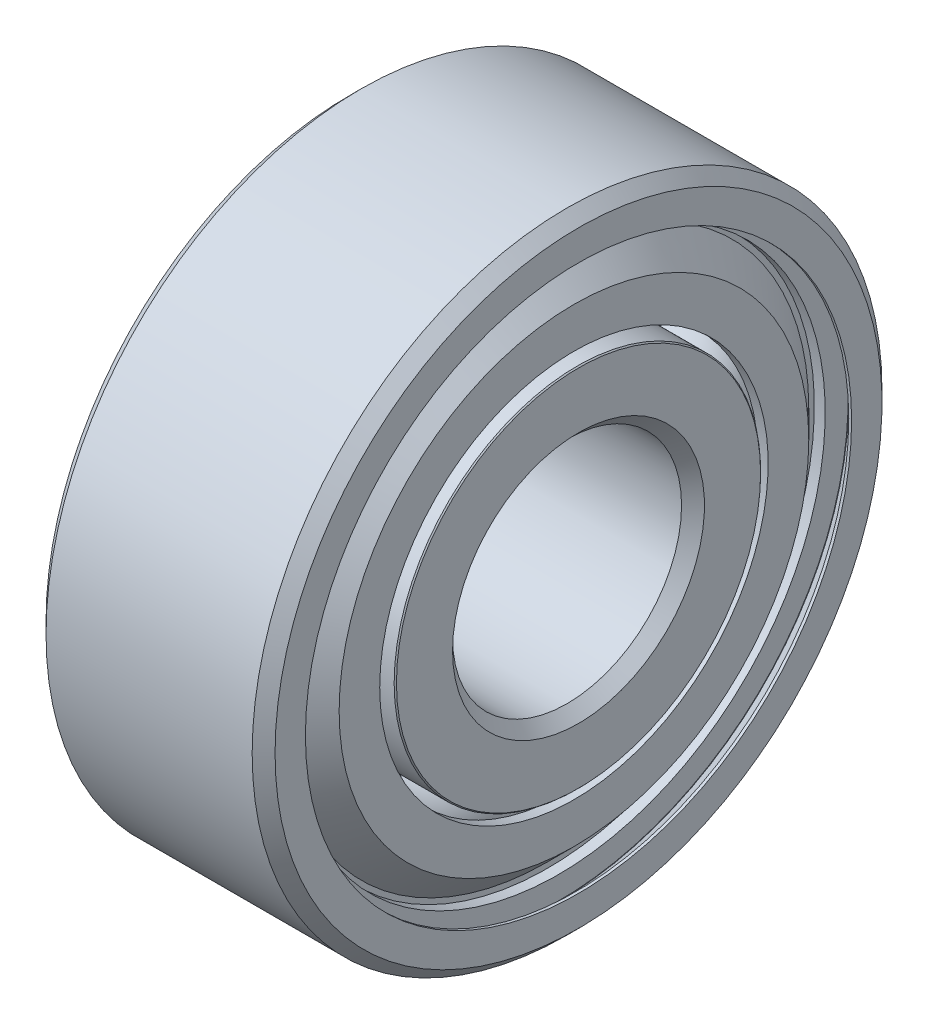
ISO-10303-21;
HEADER;
FILE_DESCRIPTION(('STEP AP214'),'2;1');
FILE_NAME('part.step','',(''),(''),'','','');
FILE_SCHEMA(('AUTOMOTIVE_DESIGN { 1 0 10303 214 1 1 1 1 }'));
ENDSEC;
DATA;
#1=APPLICATION_CONTEXT('core data for automotive mechanical design processes');
#2=APPLICATION_PROTOCOL_DEFINITION('international standard','automotive_design',2000,#1);
#3=PRODUCT_CONTEXT('',#1,'mechanical');
#4=PRODUCT('Part','Part','',(#3));
#5=PRODUCT_RELATED_PRODUCT_CATEGORY('part','',(#4));
#6=PRODUCT_DEFINITION_FORMATION('','',#4);
#7=PRODUCT_DEFINITION_CONTEXT('part definition',#1,'design');
#8=PRODUCT_DEFINITION('design','',#6,#7);
#9=PRODUCT_DEFINITION_SHAPE('','',#8);
#10=(LENGTH_UNIT() NAMED_UNIT(*) SI_UNIT(.MILLI.,.METRE.));
#11=(NAMED_UNIT(*) PLANE_ANGLE_UNIT() SI_UNIT($,.RADIAN.));
#12=(NAMED_UNIT(*) SI_UNIT($,.STERADIAN.) SOLID_ANGLE_UNIT());
#13=UNCERTAINTY_MEASURE_WITH_UNIT(LENGTH_MEASURE(1.E-05),#10,'distance_accuracy_value','');
#14=(GEOMETRIC_REPRESENTATION_CONTEXT(3) GLOBAL_UNCERTAINTY_ASSIGNED_CONTEXT((#13)) GLOBAL_UNIT_ASSIGNED_CONTEXT((#10,
#11,#12)) REPRESENTATION_CONTEXT('',''));
#15=CARTESIAN_POINT('',(0.,0.,0.));
#16=DIRECTION('',(0.,0.,1.));
#17=DIRECTION('',(1.,0.,0.));
#18=AXIS2_PLACEMENT_3D('',#15,#16,#17);
#19=CARTESIAN_POINT('',(0.,2.72236110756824,2.72236110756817));
#20=DIRECTION('',(0.,0.707106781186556,0.707106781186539));
#21=DIRECTION('',(1.,0.,0.));
#22=AXIS2_PLACEMENT_3D('',#19,#20,#21);
#23=SPHERICAL_SURFACE('',#22,1.15);
#24=CARTESIAN_POINT('',(0.,3.53553390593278,3.53553390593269));
#25=VERTEX_POINT('',#24);
#26=VERTEX_LOOP('',#25);
#27=FACE_BOUND('',#26,.T.);
#28=ADVANCED_FACE('F40',(#27),#23,.T.);
#29=CLOSED_SHELL('',(#28));
#30=MANIFOLD_SOLID_BREP('B2',#29);
#31=CARTESIAN_POINT('',(0.,0.,3.85));
#32=DIRECTION('',(0.,0.,1.));
#33=DIRECTION('',(1.,0.,0.));
#34=AXIS2_PLACEMENT_3D('',#31,#32,#33);
#35=SPHERICAL_SURFACE('',#34,1.15);
#36=CARTESIAN_POINT('',(0.,0.,5.));
#37=VERTEX_POINT('',#36);
#38=VERTEX_LOOP('',#37);
#39=FACE_BOUND('',#38,.T.);
#40=ADVANCED_FACE('F61',(#39),#35,.T.);
#41=CLOSED_SHELL('',(#40));
#42=MANIFOLD_SOLID_BREP('B6',#41);
#43=CARTESIAN_POINT('',(0.,-2.72236110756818,2.72236110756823));
#44=DIRECTION('',(0.,-0.707106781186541,0.707106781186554));
#45=DIRECTION('',(1.,0.,0.));
#46=AXIS2_PLACEMENT_3D('',#43,#44,#45);
#47=SPHERICAL_SURFACE('',#46,1.15);
#48=CARTESIAN_POINT('',(0.,-3.53553390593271,3.53553390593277));
#49=VERTEX_POINT('',#48);
#50=VERTEX_LOOP('',#49);
#51=FACE_BOUND('',#50,.T.);
#52=ADVANCED_FACE('F82',(#51),#47,.T.);
#53=CLOSED_SHELL('',(#52));
#54=MANIFOLD_SOLID_BREP('B36',#53);
#55=CARTESIAN_POINT('',(0.,-3.85,0.));
#56=DIRECTION('',(0.,-1.,0.));
#57=DIRECTION('',(1.,0.,0.));
#58=AXIS2_PLACEMENT_3D('',#55,#56,#57);
#59=SPHERICAL_SURFACE('',#58,1.15);
#60=CARTESIAN_POINT('',(0.,-5.,0.));
#61=VERTEX_POINT('',#60);
#62=VERTEX_LOOP('',#61);
#63=FACE_BOUND('',#62,.T.);
#64=ADVANCED_FACE('F103',(#63),#59,.T.);
#65=CLOSED_SHELL('',(#64));
#66=MANIFOLD_SOLID_BREP('B57',#65);
#67=CARTESIAN_POINT('',(0.,-2.72236110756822,-2.72236110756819));
#68=DIRECTION('',(0.,-0.707106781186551,-0.707106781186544));
#69=DIRECTION('',(1.,0.,0.));
#70=AXIS2_PLACEMENT_3D('',#67,#68,#69);
#71=SPHERICAL_SURFACE('',#70,1.15);
#72=CARTESIAN_POINT('',(0.,-3.53553390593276,-3.53553390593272));
#73=VERTEX_POINT('',#72);
#74=VERTEX_LOOP('',#73);
#75=FACE_BOUND('',#74,.T.);
#76=ADVANCED_FACE('F124',(#75),#71,.T.);
#77=CLOSED_SHELL('',(#76));
#78=MANIFOLD_SOLID_BREP('B78',#77);
#79=CARTESIAN_POINT('',(0.,0.,-3.85));
#80=DIRECTION('',(0.,0.,-1.));
#81=DIRECTION('',(1.,0.,0.));
#82=AXIS2_PLACEMENT_3D('',#79,#80,#81);
#83=SPHERICAL_SURFACE('',#82,1.15);
#84=CARTESIAN_POINT('',(0.,0.,-5.));
#85=VERTEX_POINT('',#84);
#86=VERTEX_LOOP('',#85);
#87=FACE_BOUND('',#86,.T.);
#88=ADVANCED_FACE('F145',(#87),#83,.T.);
#89=CLOSED_SHELL('',(#88));
#90=MANIFOLD_SOLID_BREP('B99',#89);
#91=CARTESIAN_POINT('',(0.,2.7223611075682,-2.72236110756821));
#92=DIRECTION('',(0.,0.707106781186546,-0.707106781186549));
#93=DIRECTION('',(1.,0.,0.));
#94=AXIS2_PLACEMENT_3D('',#91,#92,#93);
#95=SPHERICAL_SURFACE('',#94,1.15);
#96=CARTESIAN_POINT('',(0.,3.53553390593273,-3.53553390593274));
#97=VERTEX_POINT('',#96);
#98=VERTEX_LOOP('',#97);
#99=FACE_BOUND('',#98,.T.);
#100=ADVANCED_FACE('F166',(#99),#95,.T.);
#101=CLOSED_SHELL('',(#100));
#102=MANIFOLD_SOLID_BREP('B120',#101);
#103=CARTESIAN_POINT('',(0.,3.85,0.));
#104=DIRECTION('',(0.,1.,0.));
#105=DIRECTION('',(1.,0.,0.));
#106=AXIS2_PLACEMENT_3D('',#103,#104,#105);
#107=SPHERICAL_SURFACE('',#106,1.15);
#108=CARTESIAN_POINT('',(0.,5.,0.));
#109=VERTEX_POINT('',#108);
#110=VERTEX_LOOP('',#109);
#111=FACE_BOUND('',#110,.T.);
#112=ADVANCED_FACE('F189',(#111),#107,.T.);
#113=CLOSED_SHELL('',(#112));
#114=MANIFOLD_SOLID_BREP('B141',#113);
#115=CARTESIAN_POINT('',(0.,0.,0.));
#116=DIRECTION('',(-1.,0.,0.));
#117=DIRECTION('',(0.,0.,1.));
#118=AXIS2_PLACEMENT_3D('',#115,#116,#117);
#119=CYLINDRICAL_SURFACE('',#118,5.06042141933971);
#120=CARTESIAN_POINT('',(-1.45890813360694,0.,0.));
#121=DIRECTION('',(-1.,0.,0.));
#122=DIRECTION('',(0.,0.,1.));
#123=AXIS2_PLACEMENT_3D('',#120,#121,#122);
#124=CIRCLE('',#123,5.06042141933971);
#125=CARTESIAN_POINT('',(-1.45890813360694,0.,5.06042141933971));
#126=VERTEX_POINT('',#125);
#127=EDGE_CURVE('E225',#126,#126,#124,.T.);
#128=ORIENTED_EDGE('',*,*,#127,.T.);
#129=EDGE_LOOP('',(#128));
#130=FACE_BOUND('',#129,.T.);
#131=CARTESIAN_POINT('',(-1.64890813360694,0.,0.));
#132=DIRECTION('',(-1.,0.,0.));
#133=DIRECTION('',(0.,0.,1.));
#134=AXIS2_PLACEMENT_3D('',#131,#132,#133);
#135=CIRCLE('',#134,5.06042141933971);
#136=CARTESIAN_POINT('',(-1.64890813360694,0.,5.06042141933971));
#137=VERTEX_POINT('',#136);
#138=EDGE_CURVE('E188',#137,#137,#135,.T.);
#139=ORIENTED_EDGE('',*,*,#138,.F.);
#140=EDGE_LOOP('',(#139));
#141=FACE_BOUND('',#140,.T.);
#142=ADVANCED_FACE('F210',(#130,#141),#119,.T.);
#143=CARTESIAN_POINT('',(-1.45890813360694,5.06042141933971,0.));
#144=DIRECTION('',(1.,0.,0.));
#145=DIRECTION('',(0.,0.,-1.));
#146=AXIS2_PLACEMENT_3D('',#143,#144,#145);
#147=PLANE('',#146);
#148=CARTESIAN_POINT('',(-1.45890813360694,0.,0.));
#149=DIRECTION('',(-1.,0.,0.));
#150=DIRECTION('',(0.,0.,1.));
#151=AXIS2_PLACEMENT_3D('',#148,#149,#150);
#152=CIRCLE('',#151,4.66042141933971);
#153=CARTESIAN_POINT('',(-1.45890813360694,0.,4.66042141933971));
#154=VERTEX_POINT('',#153);
#155=EDGE_CURVE('E221',#154,#154,#152,.T.);
#156=ORIENTED_EDGE('',*,*,#155,.T.);
#157=EDGE_LOOP('',(#156));
#158=FACE_BOUND('',#157,.T.);
#159=ORIENTED_EDGE('',*,*,#127,.F.);
#160=EDGE_LOOP('',(#159));
#161=FACE_BOUND('',#160,.T.);
#162=ADVANCED_FACE('F233',(#158,#161),#147,.T.);
#163=CARTESIAN_POINT('',(0.,0.,0.));
#164=DIRECTION('',(-1.,0.,0.));
#165=DIRECTION('',(0.,0.,1.));
#166=AXIS2_PLACEMENT_3D('',#163,#164,#165);
#167=CYLINDRICAL_SURFACE('',#166,4.66042141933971);
#168=ORIENTED_EDGE('',*,*,#155,.F.);
#169=EDGE_LOOP('',(#168));
#170=FACE_BOUND('',#169,.T.);
#171=CARTESIAN_POINT('',(-1.64890813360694,0.,0.));
#172=DIRECTION('',(-1.,0.,0.));
#173=DIRECTION('',(0.,0.,1.));
#174=AXIS2_PLACEMENT_3D('',#171,#172,#173);
#175=CIRCLE('',#174,4.66042141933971);
#176=CARTESIAN_POINT('',(-1.64890813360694,0.,4.66042141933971));
#177=VERTEX_POINT('',#176);
#178=EDGE_CURVE('E217',#177,#177,#175,.T.);
#179=ORIENTED_EDGE('',*,*,#178,.T.);
#180=EDGE_LOOP('',(#179));
#181=FACE_BOUND('',#180,.T.);
#182=ADVANCED_FACE('F235',(#170,#181),#167,.F.);
#183=CARTESIAN_POINT('',(-1.64890813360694,5.06042141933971,0.));
#184=DIRECTION('',(1.,0.,0.));
#185=DIRECTION('',(0.,0.,-1.));
#186=AXIS2_PLACEMENT_3D('',#183,#184,#185);
#187=PLANE('',#186);
#188=ORIENTED_EDGE('',*,*,#178,.F.);
#189=EDGE_LOOP('',(#188));
#190=FACE_BOUND('',#189,.T.);
#191=ORIENTED_EDGE('',*,*,#138,.T.);
#192=EDGE_LOOP('',(#191));
#193=FACE_BOUND('',#192,.T.);
#194=ADVANCED_FACE('F212',(#190,#193),#187,.F.);
#195=CLOSED_SHELL('',(#142,#162,#182,#194));
#196=MANIFOLD_SOLID_BREP('B162',#195);
#197=CARTESIAN_POINT('',(0.,0.,0.));
#198=DIRECTION('',(-1.,0.,0.));
#199=DIRECTION('',(0.,0.,1.));
#200=AXIS2_PLACEMENT_3D('',#197,#198,#199);
#201=CYLINDRICAL_SURFACE('',#200,5.06042141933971);
#202=CARTESIAN_POINT('',(1.45890813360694,0.,0.));
#203=DIRECTION('',(-1.,0.,0.));
#204=DIRECTION('',(0.,0.,1.));
#205=AXIS2_PLACEMENT_3D('',#202,#203,#204);
#206=CIRCLE('',#205,5.06042141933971);
#207=CARTESIAN_POINT('',(1.45890813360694,0.,5.06042141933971));
#208=VERTEX_POINT('',#207);
#209=EDGE_CURVE('E209',#208,#208,#206,.T.);
#210=ORIENTED_EDGE('',*,*,#209,.F.);
#211=EDGE_LOOP('',(#210));
#212=FACE_BOUND('',#211,.T.);
#213=CARTESIAN_POINT('',(1.64890813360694,0.,0.));
#214=DIRECTION('',(-1.,0.,0.));
#215=DIRECTION('',(0.,0.,1.));
#216=AXIS2_PLACEMENT_3D('',#213,#214,#215);
#217=CIRCLE('',#216,5.06042141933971);
#218=CARTESIAN_POINT('',(1.64890813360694,0.,5.06042141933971));
#219=VERTEX_POINT('',#218);
#220=EDGE_CURVE('E294',#219,#219,#217,.T.);
#221=ORIENTED_EDGE('',*,*,#220,.T.);
#222=EDGE_LOOP('',(#221));
#223=FACE_BOUND('',#222,.T.);
#224=ADVANCED_FACE('F280',(#212,#223),#201,.T.);
#225=CARTESIAN_POINT('',(1.45890813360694,0.,0.));
#226=DIRECTION('',(1.,0.,0.));
#227=DIRECTION('',(0.,0.,-1.));
#228=AXIS2_PLACEMENT_3D('',#225,#226,#227);
#229=PLANE('',#228);
#230=CARTESIAN_POINT('',(1.45890813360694,0.,0.));
#231=DIRECTION('',(-1.,0.,0.));
#232=DIRECTION('',(0.,0.,1.));
#233=AXIS2_PLACEMENT_3D('',#230,#231,#232);
#234=CIRCLE('',#233,4.66042141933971);
#235=CARTESIAN_POINT('',(1.45890813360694,0.,4.66042141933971));
#236=VERTEX_POINT('',#235);
#237=EDGE_CURVE('E286',#236,#236,#234,.T.);
#238=ORIENTED_EDGE('',*,*,#237,.F.);
#239=EDGE_LOOP('',(#238));
#240=FACE_BOUND('',#239,.T.);
#241=ORIENTED_EDGE('',*,*,#209,.T.);
#242=EDGE_LOOP('',(#241));
#243=FACE_BOUND('',#242,.T.);
#244=ADVANCED_FACE('F309',(#240,#243),#229,.F.);
#245=CARTESIAN_POINT('',(0.,0.,0.));
#246=DIRECTION('',(-1.,0.,0.));
#247=DIRECTION('',(0.,0.,1.));
#248=AXIS2_PLACEMENT_3D('',#245,#246,#247);
#249=CYLINDRICAL_SURFACE('',#248,4.66042141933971);
#250=ORIENTED_EDGE('',*,*,#237,.T.);
#251=EDGE_LOOP('',(#250));
#252=FACE_BOUND('',#251,.T.);
#253=CARTESIAN_POINT('',(1.64890813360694,0.,0.));
#254=DIRECTION('',(-1.,0.,0.));
#255=DIRECTION('',(0.,0.,1.));
#256=AXIS2_PLACEMENT_3D('',#253,#254,#255);
#257=CIRCLE('',#256,4.66042141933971);
#258=CARTESIAN_POINT('',(1.64890813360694,0.,4.66042141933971));
#259=VERTEX_POINT('',#258);
#260=EDGE_CURVE('E290',#259,#259,#257,.T.);
#261=ORIENTED_EDGE('',*,*,#260,.F.);
#262=EDGE_LOOP('',(#261));
#263=FACE_BOUND('',#262,.T.);
#264=ADVANCED_FACE('F303',(#252,#263),#249,.F.);
#265=CARTESIAN_POINT('',(1.64890813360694,0.,0.));
#266=DIRECTION('',(1.,0.,0.));
#267=DIRECTION('',(0.,0.,-1.));
#268=AXIS2_PLACEMENT_3D('',#265,#266,#267);
#269=PLANE('',#268);
#270=ORIENTED_EDGE('',*,*,#260,.T.);
#271=EDGE_LOOP('',(#270));
#272=FACE_BOUND('',#271,.T.);
#273=ORIENTED_EDGE('',*,*,#220,.F.);
#274=EDGE_LOOP('',(#273));
#275=FACE_BOUND('',#274,.T.);
#276=ADVANCED_FACE('F301',(#272,#275),#269,.T.);
#277=CLOSED_SHELL('',(#224,#244,#264,#276));
#278=MANIFOLD_SOLID_BREP('B183',#277);
#279=CARTESIAN_POINT('',(-1.26704448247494,0.,0.));
#280=DIRECTION('',(-1.,0.,0.));
#281=DIRECTION('',(0.,0.,1.));
#282=AXIS2_PLACEMENT_3D('',#279,#280,#281);
#283=PLANE('',#282);
#284=CARTESIAN_POINT('',(-1.26704448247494,0.,0.));
#285=DIRECTION('',(-1.,0.,0.));
#286=DIRECTION('',(0.,0.,1.));
#287=AXIS2_PLACEMENT_3D('',#284,#285,#286);
#288=CIRCLE('',#287,4.7565158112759);
#289=CARTESIAN_POINT('',(-1.26704448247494,0.,4.7565158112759));
#290=VERTEX_POINT('',#289);
#291=EDGE_CURVE('E279',#290,#290,#288,.T.);
#292=ORIENTED_EDGE('',*,*,#291,.F.);
#293=EDGE_LOOP('',(#292));
#294=FACE_BOUND('',#293,.T.);
#295=CARTESIAN_POINT('',(-1.26704448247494,0.,0.));
#296=DIRECTION('',(-1.,0.,0.));
#297=DIRECTION('',(0.,0.,1.));
#298=AXIS2_PLACEMENT_3D('',#295,#296,#297);
#299=CIRCLE('',#298,4.5);
#300=CARTESIAN_POINT('',(-1.26704448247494,0.,4.5));
#301=VERTEX_POINT('',#300);
#302=EDGE_CURVE('E378',#301,#301,#299,.T.);
#303=ORIENTED_EDGE('',*,*,#302,.T.);
#304=EDGE_LOOP('',(#303));
#305=FACE_BOUND('',#304,.T.);
#306=ADVANCED_FACE('F350',(#294,#305),#283,.F.);
#307=CARTESIAN_POINT('',(0.,0.,0.));
#308=DIRECTION('',(-1.,0.,0.));
#309=DIRECTION('',(0.,0.,1.));
#310=AXIS2_PLACEMENT_3D('',#307,#308,#309);
#311=CYLINDRICAL_SURFACE('',#310,4.7565158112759);
#312=CARTESIAN_POINT('',(-1.44704448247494,0.,0.));
#313=DIRECTION('',(-1.,0.,0.));
#314=DIRECTION('',(0.,0.,1.));
#315=AXIS2_PLACEMENT_3D('',#312,#313,#314);
#316=CIRCLE('',#315,4.7565158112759);
#317=CARTESIAN_POINT('',(-1.44704448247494,0.,4.7565158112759));
#318=VERTEX_POINT('',#317);
#319=EDGE_CURVE('E356',#318,#318,#316,.T.);
#320=ORIENTED_EDGE('',*,*,#319,.F.);
#321=EDGE_LOOP('',(#320));
#322=FACE_BOUND('',#321,.T.);
#323=ORIENTED_EDGE('',*,*,#291,.T.);
#324=EDGE_LOOP('',(#323));
#325=FACE_BOUND('',#324,.T.);
#326=ADVANCED_FACE('F415',(#322,#325),#311,.T.);
#327=CARTESIAN_POINT('',(-1.44704448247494,0.,0.));
#328=DIRECTION('',(1.,0.,0.));
#329=DIRECTION('',(0.,0.,-1.));
#330=AXIS2_PLACEMENT_3D('',#327,#328,#329);
#331=PLANE('',#330);
#332=CARTESIAN_POINT('',(-1.44704448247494,0.,0.));
#333=DIRECTION('',(-1.,0.,0.));
#334=DIRECTION('',(0.,0.,1.));
#335=AXIS2_PLACEMENT_3D('',#332,#333,#334);
#336=CIRCLE('',#335,4.57455844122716);
#337=CARTESIAN_POINT('',(-1.44704448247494,0.,4.57455844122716));
#338=VERTEX_POINT('',#337);
#339=EDGE_CURVE('E360',#338,#338,#336,.T.);
#340=ORIENTED_EDGE('',*,*,#339,.F.);
#341=EDGE_LOOP('',(#340));
#342=FACE_BOUND('',#341,.T.);
#343=ORIENTED_EDGE('',*,*,#319,.T.);
#344=EDGE_LOOP('',(#343));
#345=FACE_BOUND('',#344,.T.);
#346=ADVANCED_FACE('F410',(#342,#345),#331,.F.);
#347=CARTESIAN_POINT('',(-1.44704448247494,0.,0.));
#348=DIRECTION('',(1.,0.,0.));
#349=DIRECTION('',(0.,0.,-1.));
#350=AXIS2_PLACEMENT_3D('',#347,#348,#349);
#351=CONICAL_SURFACE('',#350,4.57455844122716,0.785398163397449);
#352=CARTESIAN_POINT('',(-1.92036514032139,0.,0.));
#353=DIRECTION('',(-1.,0.,0.));
#354=DIRECTION('',(0.,0.,1.));
#355=AXIS2_PLACEMENT_3D('',#352,#353,#354);
#356=CIRCLE('',#355,4.10123778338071);
#357=CARTESIAN_POINT('',(-1.92036514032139,0.,4.10123778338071));
#358=VERTEX_POINT('',#357);
#359=EDGE_CURVE('E364',#358,#358,#356,.T.);
#360=ORIENTED_EDGE('',*,*,#359,.F.);
#361=EDGE_LOOP('',(#360));
#362=FACE_BOUND('',#361,.T.);
#363=ORIENTED_EDGE('',*,*,#339,.T.);
#364=EDGE_LOOP('',(#363));
#365=FACE_BOUND('',#364,.T.);
#366=ADVANCED_FACE('F404',(#362,#365),#351,.T.);
#367=CARTESIAN_POINT('',(-1.92036514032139,0.,0.));
#368=DIRECTION('',(1.,0.,0.));
#369=DIRECTION('',(0.,0.,-1.));
#370=AXIS2_PLACEMENT_3D('',#367,#368,#369);
#371=PLANE('',#370);
#372=CARTESIAN_POINT('',(-1.92036514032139,0.,0.));
#373=DIRECTION('',(-1.,0.,0.));
#374=DIRECTION('',(0.,0.,1.));
#375=AXIS2_PLACEMENT_3D('',#372,#373,#374);
#376=CIRCLE('',#375,3.39254384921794);
#377=CARTESIAN_POINT('',(-1.92036514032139,0.,3.39254384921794));
#378=VERTEX_POINT('',#377);
#379=EDGE_CURVE('E369',#378,#378,#376,.T.);
#380=ORIENTED_EDGE('',*,*,#379,.F.);
#381=EDGE_LOOP('',(#380));
#382=FACE_BOUND('',#381,.T.);
#383=ORIENTED_EDGE('',*,*,#359,.T.);
#384=EDGE_LOOP('',(#383));
#385=FACE_BOUND('',#384,.T.);
#386=ADVANCED_FACE('F398',(#382,#385),#371,.F.);
#387=CARTESIAN_POINT('',(0.,0.,0.));
#388=DIRECTION('',(-1.,0.,0.));
#389=DIRECTION('',(0.,0.,1.));
#390=AXIS2_PLACEMENT_3D('',#387,#388,#389);
#391=CYLINDRICAL_SURFACE('',#390,3.39254384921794);
#392=CARTESIAN_POINT('',(-1.74036514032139,0.,0.));
#393=DIRECTION('',(-1.,0.,0.));
#394=DIRECTION('',(0.,0.,1.));
#395=AXIS2_PLACEMENT_3D('',#392,#393,#394);
#396=CIRCLE('',#395,3.39254384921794);
#397=CARTESIAN_POINT('',(-1.74036514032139,0.,3.39254384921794));
#398=VERTEX_POINT('',#397);
#399=EDGE_CURVE('E372',#398,#398,#396,.T.);
#400=ORIENTED_EDGE('',*,*,#399,.F.);
#401=EDGE_LOOP('',(#400));
#402=FACE_BOUND('',#401,.T.);
#403=ORIENTED_EDGE('',*,*,#379,.T.);
#404=EDGE_LOOP('',(#403));
#405=FACE_BOUND('',#404,.T.);
#406=ADVANCED_FACE('F392',(#402,#405),#391,.F.);
#407=CARTESIAN_POINT('',(-1.74036514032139,0.,0.));
#408=DIRECTION('',(-1.,0.,0.));
#409=DIRECTION('',(0.,0.,1.));
#410=AXIS2_PLACEMENT_3D('',#407,#408,#409);
#411=PLANE('',#410);
#412=CARTESIAN_POINT('',(-1.74036514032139,0.,0.));
#413=DIRECTION('',(-1.,0.,0.));
#414=DIRECTION('',(0.,0.,1.));
#415=AXIS2_PLACEMENT_3D('',#412,#413,#414);
#416=CIRCLE('',#415,4.02667934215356);
#417=CARTESIAN_POINT('',(-1.74036514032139,0.,4.02667934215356));
#418=VERTEX_POINT('',#417);
#419=EDGE_CURVE('E375',#418,#418,#416,.T.);
#420=ORIENTED_EDGE('',*,*,#419,.F.);
#421=EDGE_LOOP('',(#420));
#422=FACE_BOUND('',#421,.T.);
#423=ORIENTED_EDGE('',*,*,#399,.T.);
#424=EDGE_LOOP('',(#423));
#425=FACE_BOUND('',#424,.T.);
#426=ADVANCED_FACE('F386',(#422,#425),#411,.F.);
#427=CARTESIAN_POINT('',(-1.74036514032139,0.,0.));
#428=DIRECTION('',(1.,0.,0.));
#429=DIRECTION('',(0.,0.,-1.));
#430=AXIS2_PLACEMENT_3D('',#427,#428,#429);
#431=CONICAL_SURFACE('',#430,4.02667934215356,0.785398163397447);
#432=ORIENTED_EDGE('',*,*,#302,.F.);
#433=EDGE_LOOP('',(#432));
#434=FACE_BOUND('',#433,.T.);
#435=ORIENTED_EDGE('',*,*,#419,.T.);
#436=EDGE_LOOP('',(#435));
#437=FACE_BOUND('',#436,.T.);
#438=ADVANCED_FACE('F383',(#434,#437),#431,.F.);
#439=CLOSED_SHELL('',(#306,#326,#346,#366,#386,#406,#426,#438));
#440=MANIFOLD_SOLID_BREP('B204',#439);
#441=CARTESIAN_POINT('',(1.92036514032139,0.,0.));
#442=DIRECTION('',(1.,0.,0.));
#443=DIRECTION('',(0.,0.,-1.));
#444=AXIS2_PLACEMENT_3D('',#441,#442,#443);
#445=PLANE('',#444);
#446=CARTESIAN_POINT('',(1.92036514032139,0.,0.));
#447=DIRECTION('',(-1.,0.,0.));
#448=DIRECTION('',(0.,0.,1.));
#449=AXIS2_PLACEMENT_3D('',#446,#447,#448);
#450=CIRCLE('',#449,3.39254384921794);
#451=CARTESIAN_POINT('',(1.92036514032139,0.,3.39254384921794));
#452=VERTEX_POINT('',#451);
#453=EDGE_CURVE('E508',#452,#452,#450,.T.);
#454=ORIENTED_EDGE('',*,*,#453,.T.);
#455=EDGE_LOOP('',(#454));
#456=FACE_BOUND('',#455,.T.);
#457=CARTESIAN_POINT('',(1.92036514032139,0.,0.));
#458=DIRECTION('',(-1.,0.,0.));
#459=DIRECTION('',(0.,0.,1.));
#460=AXIS2_PLACEMENT_3D('',#457,#458,#459);
#461=CIRCLE('',#460,4.10123778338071);
#462=CARTESIAN_POINT('',(1.92036514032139,0.,4.10123778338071));
#463=VERTEX_POINT('',#462);
#464=EDGE_CURVE('E349',#463,#463,#461,.T.);
#465=ORIENTED_EDGE('',*,*,#464,.F.);
#466=EDGE_LOOP('',(#465));
#467=FACE_BOUND('',#466,.T.);
#468=ADVANCED_FACE('F480',(#456,#467),#445,.T.);
#469=CARTESIAN_POINT('',(1.44704448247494,0.,0.));
#470=DIRECTION('',(-1.,0.,0.));
#471=DIRECTION('',(0.,0.,1.));
#472=AXIS2_PLACEMENT_3D('',#469,#470,#471);
#473=CONICAL_SURFACE('',#472,4.57455844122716,0.785398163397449);
#474=ORIENTED_EDGE('',*,*,#464,.T.);
#475=EDGE_LOOP('',(#474));
#476=FACE_BOUND('',#475,.T.);
#477=CARTESIAN_POINT('',(1.44704448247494,0.,0.));
#478=DIRECTION('',(-1.,0.,0.));
#479=DIRECTION('',(0.,0.,1.));
#480=AXIS2_PLACEMENT_3D('',#477,#478,#479);
#481=CIRCLE('',#480,4.57455844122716);
#482=CARTESIAN_POINT('',(1.44704448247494,0.,4.57455844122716));
#483=VERTEX_POINT('',#482);
#484=EDGE_CURVE('E486',#483,#483,#481,.T.);
#485=ORIENTED_EDGE('',*,*,#484,.F.);
#486=EDGE_LOOP('',(#485));
#487=FACE_BOUND('',#486,.T.);
#488=ADVANCED_FACE('F526',(#476,#487),#473,.T.);
#489=CARTESIAN_POINT('',(1.44704448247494,0.,0.));
#490=DIRECTION('',(1.,0.,0.));
#491=DIRECTION('',(0.,0.,-1.));
#492=AXIS2_PLACEMENT_3D('',#489,#490,#491);
#493=PLANE('',#492);
#494=ORIENTED_EDGE('',*,*,#484,.T.);
#495=EDGE_LOOP('',(#494));
#496=FACE_BOUND('',#495,.T.);
#497=CARTESIAN_POINT('',(1.44704448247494,0.,0.));
#498=DIRECTION('',(-1.,0.,0.));
#499=DIRECTION('',(0.,0.,1.));
#500=AXIS2_PLACEMENT_3D('',#497,#498,#499);
#501=CIRCLE('',#500,4.7565158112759);
#502=CARTESIAN_POINT('',(1.44704448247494,0.,4.7565158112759));
#503=VERTEX_POINT('',#502);
#504=EDGE_CURVE('E490',#503,#503,#501,.T.);
#505=ORIENTED_EDGE('',*,*,#504,.F.);
#506=EDGE_LOOP('',(#505));
#507=FACE_BOUND('',#506,.T.);
#508=ADVANCED_FACE('F530',(#496,#507),#493,.T.);
#509=CARTESIAN_POINT('',(0.,0.,0.));
#510=DIRECTION('',(-1.,0.,0.));
#511=DIRECTION('',(0.,0.,1.));
#512=AXIS2_PLACEMENT_3D('',#509,#510,#511);
#513=CYLINDRICAL_SURFACE('',#512,4.7565158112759);
#514=ORIENTED_EDGE('',*,*,#504,.T.);
#515=EDGE_LOOP('',(#514));
#516=FACE_BOUND('',#515,.T.);
#517=CARTESIAN_POINT('',(1.26704448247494,0.,0.));
#518=DIRECTION('',(-1.,0.,0.));
#519=DIRECTION('',(0.,0.,1.));
#520=AXIS2_PLACEMENT_3D('',#517,#518,#519);
#521=CIRCLE('',#520,4.7565158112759);
#522=CARTESIAN_POINT('',(1.26704448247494,0.,4.7565158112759));
#523=VERTEX_POINT('',#522);
#524=EDGE_CURVE('E494',#523,#523,#521,.T.);
#525=ORIENTED_EDGE('',*,*,#524,.F.);
#526=EDGE_LOOP('',(#525));
#527=FACE_BOUND('',#526,.T.);
#528=ADVANCED_FACE('F534',(#516,#527),#513,.T.);
#529=CARTESIAN_POINT('',(1.26704448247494,0.,0.));
#530=DIRECTION('',(-1.,0.,0.));
#531=DIRECTION('',(0.,0.,1.));
#532=AXIS2_PLACEMENT_3D('',#529,#530,#531);
#533=PLANE('',#532);
#534=ORIENTED_EDGE('',*,*,#524,.T.);
#535=EDGE_LOOP('',(#534));
#536=FACE_BOUND('',#535,.T.);
#537=CARTESIAN_POINT('',(1.26704448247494,0.,0.));
#538=DIRECTION('',(-1.,0.,0.));
#539=DIRECTION('',(0.,0.,1.));
#540=AXIS2_PLACEMENT_3D('',#537,#538,#539);
#541=CIRCLE('',#540,4.5);
#542=CARTESIAN_POINT('',(1.26704448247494,0.,4.5));
#543=VERTEX_POINT('',#542);
#544=EDGE_CURVE('E499',#543,#543,#541,.T.);
#545=ORIENTED_EDGE('',*,*,#544,.F.);
#546=EDGE_LOOP('',(#545));
#547=FACE_BOUND('',#546,.T.);
#548=ADVANCED_FACE('F540',(#536,#547),#533,.T.);
#549=CARTESIAN_POINT('',(1.74036514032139,0.,0.));
#550=DIRECTION('',(-1.,0.,0.));
#551=DIRECTION('',(0.,0.,1.));
#552=AXIS2_PLACEMENT_3D('',#549,#550,#551);
#553=CONICAL_SURFACE('',#552,4.02667934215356,0.785398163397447);
#554=ORIENTED_EDGE('',*,*,#544,.T.);
#555=EDGE_LOOP('',(#554));
#556=FACE_BOUND('',#555,.T.);
#557=CARTESIAN_POINT('',(1.74036514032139,0.,0.));
#558=DIRECTION('',(-1.,0.,0.));
#559=DIRECTION('',(0.,0.,1.));
#560=AXIS2_PLACEMENT_3D('',#557,#558,#559);
#561=CIRCLE('',#560,4.02667934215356);
#562=CARTESIAN_POINT('',(1.74036514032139,0.,4.02667934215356));
#563=VERTEX_POINT('',#562);
#564=EDGE_CURVE('E502',#563,#563,#561,.T.);
#565=ORIENTED_EDGE('',*,*,#564,.F.);
#566=EDGE_LOOP('',(#565));
#567=FACE_BOUND('',#566,.T.);
#568=ADVANCED_FACE('F522',(#556,#567),#553,.F.);
#569=CARTESIAN_POINT('',(1.74036514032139,0.,0.));
#570=DIRECTION('',(-1.,0.,0.));
#571=DIRECTION('',(0.,0.,1.));
#572=AXIS2_PLACEMENT_3D('',#569,#570,#571);
#573=PLANE('',#572);
#574=ORIENTED_EDGE('',*,*,#564,.T.);
#575=EDGE_LOOP('',(#574));
#576=FACE_BOUND('',#575,.T.);
#577=CARTESIAN_POINT('',(1.74036514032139,0.,0.));
#578=DIRECTION('',(-1.,0.,0.));
#579=DIRECTION('',(0.,0.,1.));
#580=AXIS2_PLACEMENT_3D('',#577,#578,#579);
#581=CIRCLE('',#580,3.39254384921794);
#582=CARTESIAN_POINT('',(1.74036514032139,0.,3.39254384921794));
#583=VERTEX_POINT('',#582);
#584=EDGE_CURVE('E505',#583,#583,#581,.T.);
#585=ORIENTED_EDGE('',*,*,#584,.F.);
#586=EDGE_LOOP('',(#585));
#587=FACE_BOUND('',#586,.T.);
#588=ADVANCED_FACE('F516',(#576,#587),#573,.T.);
#589=CARTESIAN_POINT('',(0.,0.,0.));
#590=DIRECTION('',(-1.,0.,0.));
#591=DIRECTION('',(0.,0.,1.));
#592=AXIS2_PLACEMENT_3D('',#589,#590,#591);
#593=CYLINDRICAL_SURFACE('',#592,3.39254384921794);
#594=ORIENTED_EDGE('',*,*,#584,.T.);
#595=EDGE_LOOP('',(#594));
#596=FACE_BOUND('',#595,.T.);
#597=ORIENTED_EDGE('',*,*,#453,.F.);
#598=EDGE_LOOP('',(#597));
#599=FACE_BOUND('',#598,.T.);
#600=ADVANCED_FACE('F514',(#596,#599),#593,.F.);
#601=CLOSED_SHELL('',(#468,#488,#508,#528,#548,#568,#588,#600));
#602=MANIFOLD_SOLID_BREP('B274',#601);
#603=CARTESIAN_POINT('',(0.,0.,0.));
#604=DIRECTION('',(-1.,0.,0.));
#605=DIRECTION('',(0.,0.,1.));
#606=AXIS2_PLACEMENT_3D('',#603,#604,#605);
#607=TOROIDAL_SURFACE('',#606,3.85,1.2);
#608=CARTESIAN_POINT('',(1.0087120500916,0.,0.));
#609=DIRECTION('',(-1.,0.,0.));
#610=DIRECTION('',(0.,0.,1.));
#611=AXIS2_PLACEMENT_3D('',#608,#609,#610);
#612=CIRCLE('',#611,3.2);
#613=CARTESIAN_POINT('',(1.0087120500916,0.,3.2));
#614=VERTEX_POINT('',#613);
#615=EDGE_CURVE('E643',#614,#614,#612,.T.);
#616=ORIENTED_EDGE('',*,*,#615,.T.);
#617=EDGE_LOOP('',(#616));
#618=FACE_BOUND('',#617,.T.);
#619=CARTESIAN_POINT('',(-1.0087120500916,0.,0.));
#620=DIRECTION('',(-1.,0.,0.));
#621=DIRECTION('',(0.,0.,1.));
#622=AXIS2_PLACEMENT_3D('',#619,#620,#621);
#623=CIRCLE('',#622,3.2);
#624=CARTESIAN_POINT('',(-1.0087120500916,0.,3.2));
#625=VERTEX_POINT('',#624);
#626=EDGE_CURVE('E479',#625,#625,#623,.T.);
#627=ORIENTED_EDGE('',*,*,#626,.F.);
#628=EDGE_LOOP('',(#627));
#629=FACE_BOUND('',#628,.T.);
#630=ADVANCED_FACE('F609',(#618,#629),#607,.F.);
#631=CARTESIAN_POINT('',(0.,0.,0.));
#632=DIRECTION('',(-1.,0.,0.));
#633=DIRECTION('',(0.,0.,1.));
#634=AXIS2_PLACEMENT_3D('',#631,#632,#633);
#635=CYLINDRICAL_SURFACE('',#634,3.2);
#636=CARTESIAN_POINT('',(-1.98,0.,0.));
#637=DIRECTION('',(-1.,0.,0.));
#638=DIRECTION('',(0.,0.,1.));
#639=AXIS2_PLACEMENT_3D('',#636,#637,#638);
#640=CIRCLE('',#639,3.2);
#641=CARTESIAN_POINT('',(-1.98,0.,3.2));
#642=VERTEX_POINT('',#641);
#643=EDGE_CURVE('E615',#642,#642,#640,.T.);
#644=ORIENTED_EDGE('',*,*,#643,.F.);
#645=EDGE_LOOP('',(#644));
#646=FACE_BOUND('',#645,.T.);
#647=ORIENTED_EDGE('',*,*,#626,.T.);
#648=EDGE_LOOP('',(#647));
#649=FACE_BOUND('',#648,.T.);
#650=ADVANCED_FACE('F693',(#646,#649),#635,.T.);
#651=CARTESIAN_POINT('',(-1.98,0.,0.));
#652=DIRECTION('',(1.,0.,0.));
#653=DIRECTION('',(0.,0.,-1.));
#654=AXIS2_PLACEMENT_3D('',#651,#652,#653);
#655=CONICAL_SURFACE('',#654,3.2,0.78539816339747);
#656=CARTESIAN_POINT('',(-2.,0.,0.));
#657=DIRECTION('',(-1.,0.,0.));
#658=DIRECTION('',(0.,0.,1.));
#659=AXIS2_PLACEMENT_3D('',#656,#657,#658);
#660=CIRCLE('',#659,3.18);
#661=CARTESIAN_POINT('',(-2.,0.,3.18));
#662=VERTEX_POINT('',#661);
#663=EDGE_CURVE('E619',#662,#662,#660,.T.);
#664=ORIENTED_EDGE('',*,*,#663,.F.);
#665=EDGE_LOOP('',(#664));
#666=FACE_BOUND('',#665,.T.);
#667=ORIENTED_EDGE('',*,*,#643,.T.);
#668=EDGE_LOOP('',(#667));
#669=FACE_BOUND('',#668,.T.);
#670=ADVANCED_FACE('F688',(#666,#669),#655,.T.);
#671=CARTESIAN_POINT('',(-2.,0.,0.));
#672=DIRECTION('',(1.,0.,0.));
#673=DIRECTION('',(0.,0.,-1.));
#674=AXIS2_PLACEMENT_3D('',#671,#672,#673);
#675=PLANE('',#674);
#676=CARTESIAN_POINT('',(-2.,0.,0.));
#677=DIRECTION('',(-1.,0.,0.));
#678=DIRECTION('',(0.,0.,1.));
#679=AXIS2_PLACEMENT_3D('',#676,#677,#678);
#680=CIRCLE('',#679,2.2);
#681=CARTESIAN_POINT('',(-2.,0.,2.2));
#682=VERTEX_POINT('',#681);
#683=EDGE_CURVE('E623',#682,#682,#680,.T.);
#684=ORIENTED_EDGE('',*,*,#683,.F.);
#685=EDGE_LOOP('',(#684));
#686=FACE_BOUND('',#685,.T.);
#687=ORIENTED_EDGE('',*,*,#663,.T.);
#688=EDGE_LOOP('',(#687));
#689=FACE_BOUND('',#688,.T.);
#690=ADVANCED_FACE('F682',(#686,#689),#675,.F.);
#691=CARTESIAN_POINT('',(-2.,0.,0.));
#692=DIRECTION('',(-1.,0.,0.));
#693=DIRECTION('',(0.,0.,1.));
#694=AXIS2_PLACEMENT_3D('',#691,#692,#693);
#695=CONICAL_SURFACE('',#694,2.2,0.785398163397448);
#696=CARTESIAN_POINT('',(-1.8,0.,0.));
#697=DIRECTION('',(-1.,0.,0.));
#698=DIRECTION('',(0.,0.,1.));
#699=AXIS2_PLACEMENT_3D('',#696,#697,#698);
#700=CIRCLE('',#699,2.);
#701=CARTESIAN_POINT('',(-1.8,0.,2.));
#702=VERTEX_POINT('',#701);
#703=EDGE_CURVE('E628',#702,#702,#700,.T.);
#704=ORIENTED_EDGE('',*,*,#703,.F.);
#705=EDGE_LOOP('',(#704));
#706=FACE_BOUND('',#705,.T.);
#707=ORIENTED_EDGE('',*,*,#683,.T.);
#708=EDGE_LOOP('',(#707));
#709=FACE_BOUND('',#708,.T.);
#710=ADVANCED_FACE('F676',(#706,#709),#695,.F.);
#711=CARTESIAN_POINT('',(0.,0.,0.));
#712=DIRECTION('',(-1.,0.,0.));
#713=DIRECTION('',(0.,0.,1.));
#714=AXIS2_PLACEMENT_3D('',#711,#712,#713);
#715=CYLINDRICAL_SURFACE('',#714,2.);
#716=CARTESIAN_POINT('',(1.8,0.,0.));
#717=DIRECTION('',(-1.,0.,0.));
#718=DIRECTION('',(0.,0.,1.));
#719=AXIS2_PLACEMENT_3D('',#716,#717,#718);
#720=CIRCLE('',#719,2.);
#721=CARTESIAN_POINT('',(1.8,0.,2.));
#722=VERTEX_POINT('',#721);
#723=EDGE_CURVE('E631',#722,#722,#720,.T.);
#724=ORIENTED_EDGE('',*,*,#723,.F.);
#725=EDGE_LOOP('',(#724));
#726=FACE_BOUND('',#725,.T.);
#727=ORIENTED_EDGE('',*,*,#703,.T.);
#728=EDGE_LOOP('',(#727));
#729=FACE_BOUND('',#728,.T.);
#730=ADVANCED_FACE('F670',(#726,#729),#715,.F.);
#731=CARTESIAN_POINT('',(1.8,0.,0.));
#732=DIRECTION('',(1.,0.,0.));
#733=DIRECTION('',(0.,0.,-1.));
#734=AXIS2_PLACEMENT_3D('',#731,#732,#733);
#735=CONICAL_SURFACE('',#734,2.,0.785398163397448);
#736=CARTESIAN_POINT('',(2.,0.,0.));
#737=DIRECTION('',(-1.,0.,0.));
#738=DIRECTION('',(0.,0.,1.));
#739=AXIS2_PLACEMENT_3D('',#736,#737,#738);
#740=CIRCLE('',#739,2.2);
#741=CARTESIAN_POINT('',(2.,0.,2.2));
#742=VERTEX_POINT('',#741);
#743=EDGE_CURVE('E634',#742,#742,#740,.T.);
#744=ORIENTED_EDGE('',*,*,#743,.F.);
#745=EDGE_LOOP('',(#744));
#746=FACE_BOUND('',#745,.T.);
#747=ORIENTED_EDGE('',*,*,#723,.T.);
#748=EDGE_LOOP('',(#747));
#749=FACE_BOUND('',#748,.T.);
#750=ADVANCED_FACE('F664',(#746,#749),#735,.F.);
#751=CARTESIAN_POINT('',(2.,0.,0.));
#752=DIRECTION('',(-1.,0.,0.));
#753=DIRECTION('',(0.,0.,1.));
#754=AXIS2_PLACEMENT_3D('',#751,#752,#753);
#755=PLANE('',#754);
#756=CARTESIAN_POINT('',(2.,0.,0.));
#757=DIRECTION('',(-1.,0.,0.));
#758=DIRECTION('',(0.,0.,1.));
#759=AXIS2_PLACEMENT_3D('',#756,#757,#758);
#760=CIRCLE('',#759,3.18);
#761=CARTESIAN_POINT('',(2.,0.,3.18));
#762=VERTEX_POINT('',#761);
#763=EDGE_CURVE('E637',#762,#762,#760,.T.);
#764=ORIENTED_EDGE('',*,*,#763,.F.);
#765=EDGE_LOOP('',(#764));
#766=FACE_BOUND('',#765,.T.);
#767=ORIENTED_EDGE('',*,*,#743,.T.);
#768=EDGE_LOOP('',(#767));
#769=FACE_BOUND('',#768,.T.);
#770=ADVANCED_FACE('F658',(#766,#769),#755,.F.);
#771=CARTESIAN_POINT('',(2.,0.,0.));
#772=DIRECTION('',(-1.,0.,0.));
#773=DIRECTION('',(0.,0.,1.));
#774=AXIS2_PLACEMENT_3D('',#771,#772,#773);
#775=CONICAL_SURFACE('',#774,3.18,0.785398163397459);
#776=CARTESIAN_POINT('',(1.98,0.,0.));
#777=DIRECTION('',(-1.,0.,0.));
#778=DIRECTION('',(0.,0.,1.));
#779=AXIS2_PLACEMENT_3D('',#776,#777,#778);
#780=CIRCLE('',#779,3.2);
#781=CARTESIAN_POINT('',(1.98,0.,3.2));
#782=VERTEX_POINT('',#781);
#783=EDGE_CURVE('E640',#782,#782,#780,.T.);
#784=ORIENTED_EDGE('',*,*,#783,.F.);
#785=EDGE_LOOP('',(#784));
#786=FACE_BOUND('',#785,.T.);
#787=ORIENTED_EDGE('',*,*,#763,.T.);
#788=EDGE_LOOP('',(#787));
#789=FACE_BOUND('',#788,.T.);
#790=ADVANCED_FACE('F652',(#786,#789),#775,.T.);
#791=CARTESIAN_POINT('',(0.,0.,0.));
#792=DIRECTION('',(-1.,0.,0.));
#793=DIRECTION('',(0.,0.,1.));
#794=AXIS2_PLACEMENT_3D('',#791,#792,#793);
#795=CYLINDRICAL_SURFACE('',#794,3.2);
#796=ORIENTED_EDGE('',*,*,#615,.F.);
#797=EDGE_LOOP('',(#796));
#798=FACE_BOUND('',#797,.T.);
#799=ORIENTED_EDGE('',*,*,#783,.T.);
#800=EDGE_LOOP('',(#799));
#801=FACE_BOUND('',#800,.T.);
#802=ADVANCED_FACE('F649',(#798,#801),#795,.T.);
#803=CLOSED_SHELL('',(#630,#650,#670,#690,#710,#730,#750,#770,#790,#802));
#804=MANIFOLD_SOLID_BREP('B344',#803);
#805=CARTESIAN_POINT('',(0.,0.,0.));
#806=DIRECTION('',(-1.,0.,0.));
#807=DIRECTION('',(0.,0.,1.));
#808=AXIS2_PLACEMENT_3D('',#805,#806,#807);
#809=TOROIDAL_SURFACE('',#808,3.85,1.2);
#810=CARTESIAN_POINT('',(-1.0087120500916,0.,0.));
#811=DIRECTION('',(-1.,0.,0.));
#812=DIRECTION('',(0.,0.,1.));
#813=AXIS2_PLACEMENT_3D('',#810,#811,#812);
#814=CIRCLE('',#813,4.5);
#815=CARTESIAN_POINT('',(-1.0087120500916,0.,4.5));
#816=VERTEX_POINT('',#815);
#817=EDGE_CURVE('E825',#816,#816,#814,.T.);
#818=ORIENTED_EDGE('',*,*,#817,.T.);
#819=EDGE_LOOP('',(#818));
#820=FACE_BOUND('',#819,.T.);
#821=CARTESIAN_POINT('',(1.0087120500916,0.,0.));
#822=DIRECTION('',(-1.,0.,0.));
#823=DIRECTION('',(0.,0.,1.));
#824=AXIS2_PLACEMENT_3D('',#821,#822,#823);
#825=CIRCLE('',#824,4.5);
#826=CARTESIAN_POINT('',(1.0087120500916,0.,4.5));
#827=VERTEX_POINT('',#826);
#828=EDGE_CURVE('E608',#827,#827,#825,.T.);
#829=ORIENTED_EDGE('',*,*,#828,.F.);
#830=EDGE_LOOP('',(#829));
#831=FACE_BOUND('',#830,.T.);
#832=ADVANCED_FACE('F761',(#820,#831),#809,.F.);
#833=CARTESIAN_POINT('',(0.,0.,0.));
#834=DIRECTION('',(-1.,0.,0.));
#835=DIRECTION('',(0.,0.,1.));
#836=AXIS2_PLACEMENT_3D('',#833,#834,#835);
#837=CYLINDRICAL_SURFACE('',#836,4.5);
#838=CARTESIAN_POINT('',(1.25,0.,0.));
#839=DIRECTION('',(-1.,0.,0.));
#840=DIRECTION('',(0.,0.,1.));
#841=AXIS2_PLACEMENT_3D('',#838,#839,#840);
#842=CIRCLE('',#841,4.5);
#843=CARTESIAN_POINT('',(1.25,0.,4.5));
#844=VERTEX_POINT('',#843);
#845=EDGE_CURVE('E767',#844,#844,#842,.T.);
#846=ORIENTED_EDGE('',*,*,#845,.F.);
#847=EDGE_LOOP('',(#846));
#848=FACE_BOUND('',#847,.T.);
#849=ORIENTED_EDGE('',*,*,#828,.T.);
#850=EDGE_LOOP('',(#849));
#851=FACE_BOUND('',#850,.T.);
#852=ADVANCED_FACE('F885',(#848,#851),#837,.F.);
#853=CARTESIAN_POINT('',(1.25,0.,0.));
#854=DIRECTION('',(1.,0.,0.));
#855=DIRECTION('',(0.,0.,-1.));
#856=AXIS2_PLACEMENT_3D('',#853,#854,#855);
#857=PLANE('',#856);
#858=ORIENTED_EDGE('',*,*,#845,.T.);
#859=EDGE_LOOP('',(#858));
#860=FACE_BOUND('',#859,.T.);
#861=CARTESIAN_POINT('',(1.25,0.,0.));
#862=DIRECTION('',(-1.,0.,0.));
#863=DIRECTION('',(0.,0.,1.));
#864=AXIS2_PLACEMENT_3D('',#861,#862,#863);
#865=CIRCLE('',#864,4.77);
#866=CARTESIAN_POINT('',(1.25,0.,4.77));
#867=VERTEX_POINT('',#866);
#868=EDGE_CURVE('E771',#867,#867,#865,.T.);
#869=ORIENTED_EDGE('',*,*,#868,.F.);
#870=EDGE_LOOP('',(#869));
#871=FACE_BOUND('',#870,.T.);
#872=ADVANCED_FACE('F889',(#860,#871),#857,.T.);
#873=CARTESIAN_POINT('',(0.,0.,0.));
#874=DIRECTION('',(-1.,0.,0.));
#875=DIRECTION('',(0.,0.,1.));
#876=AXIS2_PLACEMENT_3D('',#873,#874,#875);
#877=CYLINDRICAL_SURFACE('',#876,4.77);
#878=ORIENTED_EDGE('',*,*,#868,.T.);
#879=EDGE_LOOP('',(#878));
#880=FACE_BOUND('',#879,.T.);
#881=CARTESIAN_POINT('',(1.45,0.,0.));
#882=DIRECTION('',(-1.,0.,0.));
#883=DIRECTION('',(0.,0.,1.));
#884=AXIS2_PLACEMENT_3D('',#881,#882,#883);
#885=CIRCLE('',#884,4.77);
#886=CARTESIAN_POINT('',(1.45,0.,4.77));
#887=VERTEX_POINT('',#886);
#888=EDGE_CURVE('E775',#887,#887,#885,.T.);
#889=ORIENTED_EDGE('',*,*,#888,.F.);
#890=EDGE_LOOP('',(#889));
#891=FACE_BOUND('',#890,.T.);
#892=ADVANCED_FACE('F894',(#880,#891),#877,.F.);
#893=CARTESIAN_POINT('',(1.45,0.,0.));
#894=DIRECTION('',(1.,0.,0.));
#895=DIRECTION('',(0.,0.,-1.));
#896=AXIS2_PLACEMENT_3D('',#893,#894,#895);
#897=PLANE('',#896);
#898=ORIENTED_EDGE('',*,*,#888,.T.);
#899=EDGE_LOOP('',(#898));
#900=FACE_BOUND('',#899,.T.);
#901=CARTESIAN_POINT('',(1.45,0.,0.));
#902=DIRECTION('',(-1.,0.,0.));
#903=DIRECTION('',(0.,0.,1.));
#904=AXIS2_PLACEMENT_3D('',#901,#902,#903);
#905=CIRCLE('',#904,5.07);
#906=CARTESIAN_POINT('',(1.45,0.,5.07));
#907=VERTEX_POINT('',#906);
#908=EDGE_CURVE('E780',#907,#907,#905,.T.);
#909=ORIENTED_EDGE('',*,*,#908,.F.);
#910=EDGE_LOOP('',(#909));
#911=FACE_BOUND('',#910,.T.);
#912=ADVANCED_FACE('F899',(#900,#911),#897,.T.);
#913=CARTESIAN_POINT('',(0.,0.,0.));
#914=DIRECTION('',(-1.,0.,0.));
#915=DIRECTION('',(0.,0.,1.));
#916=AXIS2_PLACEMENT_3D('',#913,#914,#915);
#917=CYLINDRICAL_SURFACE('',#916,5.07);
#918=ORIENTED_EDGE('',*,*,#908,.T.);
#919=EDGE_LOOP('',(#918));
#920=FACE_BOUND('',#919,.T.);
#921=CARTESIAN_POINT('',(1.65,0.,0.));
#922=DIRECTION('',(-1.,0.,0.));
#923=DIRECTION('',(0.,0.,1.));
#924=AXIS2_PLACEMENT_3D('',#921,#922,#923);
#925=CIRCLE('',#924,5.07);
#926=CARTESIAN_POINT('',(1.65,0.,5.07));
#927=VERTEX_POINT('',#926);
#928=EDGE_CURVE('E783',#927,#927,#925,.T.);
#929=ORIENTED_EDGE('',*,*,#928,.F.);
#930=EDGE_LOOP('',(#929));
#931=FACE_BOUND('',#930,.T.);
#932=ADVANCED_FACE('F903',(#920,#931),#917,.F.);
#933=CARTESIAN_POINT('',(1.95,0.,0.));
#934=DIRECTION('',(-1.,0.,0.));
#935=DIRECTION('',(0.,0.,1.));
#936=AXIS2_PLACEMENT_3D('',#933,#934,#935);
#937=CONICAL_SURFACE('',#936,4.77,0.78539816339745);
#938=ORIENTED_EDGE('',*,*,#928,.T.);
#939=EDGE_LOOP('',(#938));
#940=FACE_BOUND('',#939,.T.);
#941=CARTESIAN_POINT('',(1.95,0.,0.));
#942=DIRECTION('',(-1.,0.,0.));
#943=DIRECTION('',(0.,0.,1.));
#944=AXIS2_PLACEMENT_3D('',#941,#942,#943);
#945=CIRCLE('',#944,4.77);
#946=CARTESIAN_POINT('',(1.95,0.,4.77));
#947=VERTEX_POINT('',#946);
#948=EDGE_CURVE('E786',#947,#947,#945,.T.);
#949=ORIENTED_EDGE('',*,*,#948,.F.);
#950=EDGE_LOOP('',(#949));
#951=FACE_BOUND('',#950,.T.);
#952=ADVANCED_FACE('F907',(#940,#951),#937,.F.);
#953=CARTESIAN_POINT('',(0.,0.,0.));
#954=DIRECTION('',(-1.,0.,0.));
#955=DIRECTION('',(0.,0.,1.));
#956=AXIS2_PLACEMENT_3D('',#953,#954,#955);
#957=CYLINDRICAL_SURFACE('',#956,4.77);
#958=ORIENTED_EDGE('',*,*,#948,.T.);
#959=EDGE_LOOP('',(#958));
#960=FACE_BOUND('',#959,.T.);
#961=CARTESIAN_POINT('',(2.,0.,0.));
#962=DIRECTION('',(-1.,0.,0.));
#963=DIRECTION('',(0.,0.,1.));
#964=AXIS2_PLACEMENT_3D('',#961,#962,#963);
#965=CIRCLE('',#964,4.77);
#966=CARTESIAN_POINT('',(2.,0.,4.77));
#967=VERTEX_POINT('',#966);
#968=EDGE_CURVE('E789',#967,#967,#965,.T.);
#969=ORIENTED_EDGE('',*,*,#968,.F.);
#970=EDGE_LOOP('',(#969));
#971=FACE_BOUND('',#970,.T.);
#972=ADVANCED_FACE('F911',(#960,#971),#957,.F.);
#973=CARTESIAN_POINT('',(2.,0.,0.));
#974=DIRECTION('',(-1.,0.,0.));
#975=DIRECTION('',(0.,0.,1.));
#976=AXIS2_PLACEMENT_3D('',#973,#974,#975);
#977=PLANE('',#976);
#978=CARTESIAN_POINT('',(2.,0.,0.));
#979=DIRECTION('',(-1.,0.,0.));
#980=DIRECTION('',(0.,0.,1.));
#981=AXIS2_PLACEMENT_3D('',#978,#979,#980);
#982=CIRCLE('',#981,5.3);
#983=CARTESIAN_POINT('',(2.,0.,5.3));
#984=VERTEX_POINT('',#983);
#985=EDGE_CURVE('E792',#984,#984,#982,.T.);
#986=ORIENTED_EDGE('',*,*,#985,.F.);
#987=EDGE_LOOP('',(#986));
#988=FACE_BOUND('',#987,.T.);
#989=ORIENTED_EDGE('',*,*,#968,.T.);
#990=EDGE_LOOP('',(#989));
#991=FACE_BOUND('',#990,.T.);
#992=ADVANCED_FACE('F915',(#988,#991),#977,.F.);
#993=CARTESIAN_POINT('',(1.8,0.,0.));
#994=DIRECTION('',(-1.,0.,0.));
#995=DIRECTION('',(0.,0.,1.));
#996=AXIS2_PLACEMENT_3D('',#993,#994,#995);
#997=CONICAL_SURFACE('',#996,5.5,0.785398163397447);
#998=ORIENTED_EDGE('',*,*,#985,.T.);
#999=EDGE_LOOP('',(#998));
#1000=FACE_BOUND('',#999,.T.);
#1001=CARTESIAN_POINT('',(1.8,0.,0.));
#1002=DIRECTION('',(-1.,0.,0.));
#1003=DIRECTION('',(0.,0.,1.));
#1004=AXIS2_PLACEMENT_3D('',#1001,#1002,#1003);
#1005=CIRCLE('',#1004,5.5);
#1006=CARTESIAN_POINT('',(1.8,0.,5.5));
#1007=VERTEX_POINT('',#1006);
#1008=EDGE_CURVE('E795',#1007,#1007,#1005,.T.);
#1009=ORIENTED_EDGE('',*,*,#1008,.F.);
#1010=EDGE_LOOP('',(#1009));
#1011=FACE_BOUND('',#1010,.T.);
#1012=ADVANCED_FACE('F919',(#1000,#1011),#997,.T.);
#1013=CARTESIAN_POINT('',(0.,0.,0.));
#1014=DIRECTION('',(-1.,0.,0.));
#1015=DIRECTION('',(0.,0.,1.));
#1016=AXIS2_PLACEMENT_3D('',#1013,#1014,#1015);
#1017=CYLINDRICAL_SURFACE('',#1016,5.5);
#1018=ORIENTED_EDGE('',*,*,#1008,.T.);
#1019=EDGE_LOOP('',(#1018));
#1020=FACE_BOUND('',#1019,.T.);
#1021=CARTESIAN_POINT('',(-1.8,0.,0.));
#1022=DIRECTION('',(-1.,0.,0.));
#1023=DIRECTION('',(0.,0.,1.));
#1024=AXIS2_PLACEMENT_3D('',#1021,#1022,#1023);
#1025=CIRCLE('',#1024,5.5);
#1026=CARTESIAN_POINT('',(-1.8,0.,5.5));
#1027=VERTEX_POINT('',#1026);
#1028=EDGE_CURVE('E798',#1027,#1027,#1025,.T.);
#1029=ORIENTED_EDGE('',*,*,#1028,.F.);
#1030=EDGE_LOOP('',(#1029));
#1031=FACE_BOUND('',#1030,.T.);
#1032=ADVANCED_FACE('F881',(#1020,#1031),#1017,.T.);
#1033=CARTESIAN_POINT('',(-2.,0.,0.));
#1034=DIRECTION('',(1.,0.,0.));
#1035=DIRECTION('',(0.,0.,-1.));
#1036=AXIS2_PLACEMENT_3D('',#1033,#1034,#1035);
#1037=CONICAL_SURFACE('',#1036,5.3,0.785398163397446);
#1038=ORIENTED_EDGE('',*,*,#1028,.T.);
#1039=EDGE_LOOP('',(#1038));
#1040=FACE_BOUND('',#1039,.T.);
#1041=CARTESIAN_POINT('',(-2.,0.,0.));
#1042=DIRECTION('',(-1.,0.,0.));
#1043=DIRECTION('',(0.,0.,1.));
#1044=AXIS2_PLACEMENT_3D('',#1041,#1042,#1043);
#1045=CIRCLE('',#1044,5.3);
#1046=CARTESIAN_POINT('',(-2.,0.,5.3));
#1047=VERTEX_POINT('',#1046);
#1048=EDGE_CURVE('E801',#1047,#1047,#1045,.T.);
#1049=ORIENTED_EDGE('',*,*,#1048,.F.);
#1050=EDGE_LOOP('',(#1049));
#1051=FACE_BOUND('',#1050,.T.);
#1052=ADVANCED_FACE('F875',(#1040,#1051),#1037,.T.);
#1053=CARTESIAN_POINT('',(-2.,0.,0.));
#1054=DIRECTION('',(-1.,0.,0.));
#1055=DIRECTION('',(0.,0.,1.));
#1056=AXIS2_PLACEMENT_3D('',#1053,#1054,#1055);
#1057=PLANE('',#1056);
#1058=ORIENTED_EDGE('',*,*,#1048,.T.);
#1059=EDGE_LOOP('',(#1058));
#1060=FACE_BOUND('',#1059,.T.);
#1061=CARTESIAN_POINT('',(-2.,0.,0.));
#1062=DIRECTION('',(-1.,0.,0.));
#1063=DIRECTION('',(0.,0.,1.));
#1064=AXIS2_PLACEMENT_3D('',#1061,#1062,#1063);
#1065=CIRCLE('',#1064,4.77);
#1066=CARTESIAN_POINT('',(-2.,0.,4.77));
#1067=VERTEX_POINT('',#1066);
#1068=EDGE_CURVE('E804',#1067,#1067,#1065,.T.);
#1069=ORIENTED_EDGE('',*,*,#1068,.F.);
#1070=EDGE_LOOP('',(#1069));
#1071=FACE_BOUND('',#1070,.T.);
#1072=ADVANCED_FACE('F870',(#1060,#1071),#1057,.T.);
#1073=CARTESIAN_POINT('',(0.,0.,0.));
#1074=DIRECTION('',(-1.,0.,0.));
#1075=DIRECTION('',(0.,0.,1.));
#1076=AXIS2_PLACEMENT_3D('',#1073,#1074,#1075);
#1077=CYLINDRICAL_SURFACE('',#1076,4.77);
#1078=CARTESIAN_POINT('',(-1.95,0.,0.));
#1079=DIRECTION('',(-1.,0.,0.));
#1080=DIRECTION('',(0.,0.,1.));
#1081=AXIS2_PLACEMENT_3D('',#1078,#1079,#1080);
#1082=CIRCLE('',#1081,4.77);
#1083=CARTESIAN_POINT('',(-1.95,0.,4.77));
#1084=VERTEX_POINT('',#1083);
#1085=EDGE_CURVE('E807',#1084,#1084,#1082,.T.);
#1086=ORIENTED_EDGE('',*,*,#1085,.F.);
#1087=EDGE_LOOP('',(#1086));
#1088=FACE_BOUND('',#1087,.T.);
#1089=ORIENTED_EDGE('',*,*,#1068,.T.);
#1090=EDGE_LOOP('',(#1089));
#1091=FACE_BOUND('',#1090,.T.);
#1092=ADVANCED_FACE('F864',(#1088,#1091),#1077,.F.);
#1093=CARTESIAN_POINT('',(-1.95,0.,0.));
#1094=DIRECTION('',(1.,0.,0.));
#1095=DIRECTION('',(0.,0.,-1.));
#1096=AXIS2_PLACEMENT_3D('',#1093,#1094,#1095);
#1097=CONICAL_SURFACE('',#1096,4.77,0.785398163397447);
#1098=CARTESIAN_POINT('',(-1.65,0.,0.));
#1099=DIRECTION('',(-1.,0.,0.));
#1100=DIRECTION('',(0.,0.,1.));
#1101=AXIS2_PLACEMENT_3D('',#1098,#1099,#1100);
#1102=CIRCLE('',#1101,5.07);
#1103=CARTESIAN_POINT('',(-1.65,0.,5.07));
#1104=VERTEX_POINT('',#1103);
#1105=EDGE_CURVE('E810',#1104,#1104,#1102,.T.);
#1106=ORIENTED_EDGE('',*,*,#1105,.F.);
#1107=EDGE_LOOP('',(#1106));
#1108=FACE_BOUND('',#1107,.T.);
#1109=ORIENTED_EDGE('',*,*,#1085,.T.);
#1110=EDGE_LOOP('',(#1109));
#1111=FACE_BOUND('',#1110,.T.);
#1112=ADVANCED_FACE('F858',(#1108,#1111),#1097,.F.);
#1113=CARTESIAN_POINT('',(0.,0.,0.));
#1114=DIRECTION('',(-1.,0.,0.));
#1115=DIRECTION('',(0.,0.,1.));
#1116=AXIS2_PLACEMENT_3D('',#1113,#1114,#1115);
#1117=CYLINDRICAL_SURFACE('',#1116,5.07);
#1118=CARTESIAN_POINT('',(-1.45,0.,0.));
#1119=DIRECTION('',(-1.,0.,0.));
#1120=DIRECTION('',(0.,0.,1.));
#1121=AXIS2_PLACEMENT_3D('',#1118,#1119,#1120);
#1122=CIRCLE('',#1121,5.07);
#1123=CARTESIAN_POINT('',(-1.45,0.,5.07));
#1124=VERTEX_POINT('',#1123);
#1125=EDGE_CURVE('E813',#1124,#1124,#1122,.T.);
#1126=ORIENTED_EDGE('',*,*,#1125,.F.);
#1127=EDGE_LOOP('',(#1126));
#1128=FACE_BOUND('',#1127,.T.);
#1129=ORIENTED_EDGE('',*,*,#1105,.T.);
#1130=EDGE_LOOP('',(#1129));
#1131=FACE_BOUND('',#1130,.T.);
#1132=ADVANCED_FACE('F852',(#1128,#1131),#1117,.F.);
#1133=CARTESIAN_POINT('',(-1.45,0.,0.));
#1134=DIRECTION('',(1.,0.,0.));
#1135=DIRECTION('',(0.,0.,-1.));
#1136=AXIS2_PLACEMENT_3D('',#1133,#1134,#1135);
#1137=PLANE('',#1136);
#1138=CARTESIAN_POINT('',(-1.45,0.,0.));
#1139=DIRECTION('',(-1.,0.,0.));
#1140=DIRECTION('',(0.,0.,1.));
#1141=AXIS2_PLACEMENT_3D('',#1138,#1139,#1140);
#1142=CIRCLE('',#1141,4.77);
#1143=CARTESIAN_POINT('',(-1.45,0.,4.77));
#1144=VERTEX_POINT('',#1143);
#1145=EDGE_CURVE('E816',#1144,#1144,#1142,.T.);
#1146=ORIENTED_EDGE('',*,*,#1145,.F.);
#1147=EDGE_LOOP('',(#1146));
#1148=FACE_BOUND('',#1147,.T.);
#1149=ORIENTED_EDGE('',*,*,#1125,.T.);
#1150=EDGE_LOOP('',(#1149));
#1151=FACE_BOUND('',#1150,.T.);
#1152=ADVANCED_FACE('F846',(#1148,#1151),#1137,.F.);
#1153=CARTESIAN_POINT('',(0.,0.,0.));
#1154=DIRECTION('',(-1.,0.,0.));
#1155=DIRECTION('',(0.,0.,1.));
#1156=AXIS2_PLACEMENT_3D('',#1153,#1154,#1155);
#1157=CYLINDRICAL_SURFACE('',#1156,4.77);
#1158=CARTESIAN_POINT('',(-1.25,0.,0.));
#1159=DIRECTION('',(-1.,0.,0.));
#1160=DIRECTION('',(0.,0.,1.));
#1161=AXIS2_PLACEMENT_3D('',#1158,#1159,#1160);
#1162=CIRCLE('',#1161,4.77);
#1163=CARTESIAN_POINT('',(-1.25,0.,4.77));
#1164=VERTEX_POINT('',#1163);
#1165=EDGE_CURVE('E819',#1164,#1164,#1162,.T.);
#1166=ORIENTED_EDGE('',*,*,#1165,.F.);
#1167=EDGE_LOOP('',(#1166));
#1168=FACE_BOUND('',#1167,.T.);
#1169=ORIENTED_EDGE('',*,*,#1145,.T.);
#1170=EDGE_LOOP('',(#1169));
#1171=FACE_BOUND('',#1170,.T.);
#1172=ADVANCED_FACE('F840',(#1168,#1171),#1157,.F.);
#1173=CARTESIAN_POINT('',(-1.25,0.,0.));
#1174=DIRECTION('',(1.,0.,0.));
#1175=DIRECTION('',(0.,0.,-1.));
#1176=AXIS2_PLACEMENT_3D('',#1173,#1174,#1175);
#1177=PLANE('',#1176);
#1178=CARTESIAN_POINT('',(-1.25,0.,0.));
#1179=DIRECTION('',(-1.,0.,0.));
#1180=DIRECTION('',(0.,0.,1.));
#1181=AXIS2_PLACEMENT_3D('',#1178,#1179,#1180);
#1182=CIRCLE('',#1181,4.5);
#1183=CARTESIAN_POINT('',(-1.25,0.,4.5));
#1184=VERTEX_POINT('',#1183);
#1185=EDGE_CURVE('E822',#1184,#1184,#1182,.T.);
#1186=ORIENTED_EDGE('',*,*,#1185,.F.);
#1187=EDGE_LOOP('',(#1186));
#1188=FACE_BOUND('',#1187,.T.);
#1189=ORIENTED_EDGE('',*,*,#1165,.T.);
#1190=EDGE_LOOP('',(#1189));
#1191=FACE_BOUND('',#1190,.T.);
#1192=ADVANCED_FACE('F834',(#1188,#1191),#1177,.F.);
#1193=CARTESIAN_POINT('',(0.,0.,0.));
#1194=DIRECTION('',(-1.,0.,0.));
#1195=DIRECTION('',(0.,0.,1.));
#1196=AXIS2_PLACEMENT_3D('',#1193,#1194,#1195);
#1197=CYLINDRICAL_SURFACE('',#1196,4.5);
#1198=ORIENTED_EDGE('',*,*,#817,.F.);
#1199=EDGE_LOOP('',(#1198));
#1200=FACE_BOUND('',#1199,.T.);
#1201=ORIENTED_EDGE('',*,*,#1185,.T.);
#1202=EDGE_LOOP('',(#1201));
#1203=FACE_BOUND('',#1202,.T.);
#1204=ADVANCED_FACE('F831',(#1200,#1203),#1197,.F.);
#1205=CLOSED_SHELL('',(#832,#852,#872,#892,#912,#932,#952,#972,#992,#1012,#1032,#1052,#1072,
#1092,#1112,#1132,#1152,#1172,#1192,#1204));
#1206=MANIFOLD_SOLID_BREP('B474',#1205);
#1207=ADVANCED_BREP_SHAPE_REPRESENTATION('',(#18,#30,#42,#54,#66,#78,#90,#102,#114,#196,#278,
#440,#602,#804,#1206),#14);
#1208=SHAPE_DEFINITION_REPRESENTATION(#9,#1207);
ENDSEC;
END-ISO-10303-21;
